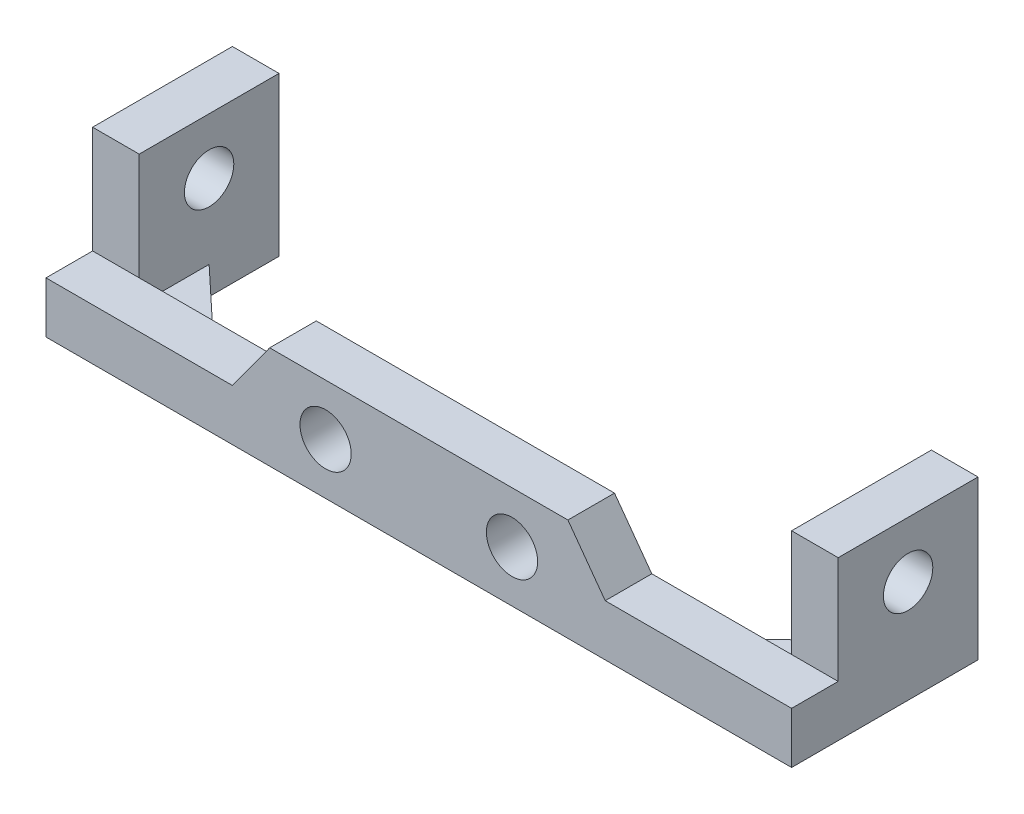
ISO-10303-21;
HEADER;
FILE_DESCRIPTION(('STEP AP214'),'2;1');
FILE_NAME('part.step','',(''),(''),'','','');
FILE_SCHEMA(('AUTOMOTIVE_DESIGN { 1 0 10303 214 1 1 1 1 }'));
ENDSEC;
DATA;
#1=APPLICATION_CONTEXT('core data for automotive mechanical design processes');
#2=APPLICATION_PROTOCOL_DEFINITION('international standard','automotive_design',2000,#1);
#3=PRODUCT_CONTEXT('',#1,'mechanical');
#4=PRODUCT('Part','Part','',(#3));
#5=PRODUCT_RELATED_PRODUCT_CATEGORY('part','',(#4));
#6=PRODUCT_DEFINITION_FORMATION('','',#4);
#7=PRODUCT_DEFINITION_CONTEXT('part definition',#1,'design');
#8=PRODUCT_DEFINITION('design','',#6,#7);
#9=PRODUCT_DEFINITION_SHAPE('','',#8);
#10=(LENGTH_UNIT() NAMED_UNIT(*) SI_UNIT(.MILLI.,.METRE.));
#11=(NAMED_UNIT(*) PLANE_ANGLE_UNIT() SI_UNIT($,.RADIAN.));
#12=(NAMED_UNIT(*) SI_UNIT($,.STERADIAN.) SOLID_ANGLE_UNIT());
#13=UNCERTAINTY_MEASURE_WITH_UNIT(LENGTH_MEASURE(1.E-05),#10,'distance_accuracy_value','');
#14=(GEOMETRIC_REPRESENTATION_CONTEXT(3) GLOBAL_UNCERTAINTY_ASSIGNED_CONTEXT((#13)) GLOBAL_UNIT_ASSIGNED_CONTEXT((#10,
#11,#12)) REPRESENTATION_CONTEXT('',''));
#15=CARTESIAN_POINT('',(0.,0.,0.));
#16=DIRECTION('',(0.,0.,1.));
#17=DIRECTION('',(1.,0.,0.));
#18=AXIS2_PLACEMENT_3D('',#15,#16,#17);
#19=CARTESIAN_POINT('',(0.,11.,-5.));
#20=DIRECTION('',(0.,0.,1.));
#21=DIRECTION('',(1.,0.,0.));
#22=AXIS2_PLACEMENT_3D('',#19,#20,#21);
#23=PLANE('',#22);
#24=CARTESIAN_POINT('',(50.,5.5,-5.));
#25=DIRECTION('',(0.,0.,1.));
#26=DIRECTION('',(1.,0.,0.));
#27=AXIS2_PLACEMENT_3D('',#24,#25,#26);
#28=CIRCLE('',#27,2.75);
#29=CARTESIAN_POINT('',(52.75,5.5,-5.));
#30=VERTEX_POINT('',#29);
#31=EDGE_CURVE('E282',#30,#30,#28,.T.);
#32=ORIENTED_EDGE('',*,*,#31,.T.);
#33=EDGE_LOOP('',(#32));
#34=FACE_BOUND('',#33,.T.);
#35=CARTESIAN_POINT('',(30.,5.5,-5.));
#36=DIRECTION('',(0.,0.,1.));
#37=DIRECTION('',(1.,0.,0.));
#38=AXIS2_PLACEMENT_3D('',#35,#36,#37);
#39=CIRCLE('',#38,2.75);
#40=CARTESIAN_POINT('',(32.75,5.5,-5.));
#41=VERTEX_POINT('',#40);
#42=EDGE_CURVE('E288',#41,#41,#39,.T.);
#43=ORIENTED_EDGE('',*,*,#42,.T.);
#44=EDGE_LOOP('',(#43));
#45=FACE_BOUND('',#44,.T.);
#46=DIRECTION('',(-1.,0.,0.));
#47=VECTOR('',#46,1.);
#48=CARTESIAN_POINT('',(75.,3.,-5.));
#49=LINE('',#48,#47);
#50=CARTESIAN_POINT('',(75.,3.,-5.));
#51=VERTEX_POINT('',#50);
#52=CARTESIAN_POINT('',(67.,3.,-5.));
#53=VERTEX_POINT('',#52);
#54=EDGE_CURVE('E177',#51,#53,#49,.T.);
#55=ORIENTED_EDGE('',*,*,#54,.T.);
#56=DIRECTION('',(0.,-1.,0.));
#57=VECTOR('',#56,1.);
#58=CARTESIAN_POINT('',(67.,3.,-5.));
#59=LINE('',#58,#57);
#60=CARTESIAN_POINT('',(67.,0.,-5.));
#61=VERTEX_POINT('',#60);
#62=EDGE_CURVE('E165',#53,#61,#59,.T.);
#63=ORIENTED_EDGE('',*,*,#62,.T.);
#64=DIRECTION('',(-1.,0.,0.));
#65=VECTOR('',#64,1.);
#66=CARTESIAN_POINT('',(0.,0.,-5.));
#67=LINE('',#66,#65);
#68=CARTESIAN_POINT('',(13.,0.,-5.));
#69=VERTEX_POINT('',#68);
#70=EDGE_CURVE('E312',#61,#69,#67,.T.);
#71=ORIENTED_EDGE('',*,*,#70,.T.);
#72=DIRECTION('',(0.,-1.,0.));
#73=VECTOR('',#72,1.);
#74=CARTESIAN_POINT('',(13.,3.,-5.));
#75=LINE('',#74,#73);
#76=CARTESIAN_POINT('',(13.,3.,-5.));
#77=VERTEX_POINT('',#76);
#78=EDGE_CURVE('E204',#77,#69,#75,.T.);
#79=ORIENTED_EDGE('',*,*,#78,.F.);
#80=DIRECTION('',(-1.,0.,0.));
#81=VECTOR('',#80,1.);
#82=CARTESIAN_POINT('',(13.,3.,-5.));
#83=LINE('',#82,#81);
#84=CARTESIAN_POINT('',(5.,3.,-5.));
#85=VERTEX_POINT('',#84);
#86=EDGE_CURVE('E198',#77,#85,#83,.T.);
#87=ORIENTED_EDGE('',*,*,#86,.T.);
#88=DIRECTION('',(0.,-1.,0.));
#89=VECTOR('',#88,1.);
#90=CARTESIAN_POINT('',(5.,17.,-5.));
#91=LINE('',#90,#89);
#92=CARTESIAN_POINT('',(5.,5.5,-5.));
#93=VERTEX_POINT('',#92);
#94=EDGE_CURVE('E11',#93,#85,#91,.T.);
#95=ORIENTED_EDGE('',*,*,#94,.F.);
#96=DIRECTION('',(-1.,0.,0.));
#97=VECTOR('',#96,1.);
#98=CARTESIAN_POINT('',(0.,5.5,-5.));
#99=LINE('',#98,#97);
#100=CARTESIAN_POINT('',(20.,5.5,-5.));
#101=VERTEX_POINT('',#100);
#102=EDGE_CURVE('E294',#101,#93,#99,.T.);
#103=ORIENTED_EDGE('',*,*,#102,.F.);
#104=DIRECTION('',(0.588171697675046,0.808736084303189,0.));
#105=VECTOR('',#104,1.);
#106=CARTESIAN_POINT('',(10.4648648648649,-7.61081081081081,-5.));
#107=LINE('',#106,#105);
#108=CARTESIAN_POINT('',(24.,11.,-5.));
#109=VERTEX_POINT('',#108);
#110=EDGE_CURVE('E298',#101,#109,#107,.T.);
#111=ORIENTED_EDGE('',*,*,#110,.T.);
#112=DIRECTION('',(-1.,0.,0.));
#113=VECTOR('',#112,1.);
#114=CARTESIAN_POINT('',(0.,11.,-5.));
#115=LINE('',#114,#113);
#116=CARTESIAN_POINT('',(56.,11.,-5.));
#117=VERTEX_POINT('',#116);
#118=EDGE_CURVE('E322',#117,#109,#115,.T.);
#119=ORIENTED_EDGE('',*,*,#118,.F.);
#120=DIRECTION('',(-0.588171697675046,0.808736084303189,0.));
#121=VECTOR('',#120,1.);
#122=CARTESIAN_POINT('',(41.8594594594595,30.4432432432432,-5.));
#123=LINE('',#122,#121);
#124=CARTESIAN_POINT('',(60.,5.5,-5.));
#125=VERTEX_POINT('',#124);
#126=EDGE_CURVE('E266',#125,#117,#123,.T.);
#127=ORIENTED_EDGE('',*,*,#126,.F.);
#128=DIRECTION('',(1.,0.,0.));
#129=VECTOR('',#128,1.);
#130=CARTESIAN_POINT('',(0.,5.5,-5.));
#131=LINE('',#130,#129);
#132=CARTESIAN_POINT('',(75.,5.5,-5.));
#133=VERTEX_POINT('',#132);
#134=EDGE_CURVE('E269',#125,#133,#131,.T.);
#135=ORIENTED_EDGE('',*,*,#134,.T.);
#136=DIRECTION('',(0.,-1.,0.));
#137=VECTOR('',#136,1.);
#138=CARTESIAN_POINT('',(75.,17.,-5.));
#139=LINE('',#138,#137);
#140=EDGE_CURVE('E183',#133,#51,#139,.T.);
#141=ORIENTED_EDGE('',*,*,#140,.T.);
#142=EDGE_LOOP('',(#55,#63,#71,#79,#87,#95,#103,#111,#119,#127,#135,#141));
#143=FACE_BOUND('',#142,.T.);
#144=ADVANCED_FACE('F32',(#34,#45,#143),#23,.F.);
#145=CARTESIAN_POINT('',(0.,11.,0.));
#146=DIRECTION('',(0.,0.,-1.));
#147=DIRECTION('',(-1.,0.,0.));
#148=AXIS2_PLACEMENT_3D('',#145,#146,#147);
#149=PLANE('',#148);
#150=CARTESIAN_POINT('',(30.,5.5,0.));
#151=DIRECTION('',(0.,0.,1.));
#152=DIRECTION('',(1.,0.,0.));
#153=AXIS2_PLACEMENT_3D('',#150,#151,#152);
#154=CIRCLE('',#153,2.75);
#155=CARTESIAN_POINT('',(32.75,5.5,0.));
#156=VERTEX_POINT('',#155);
#157=EDGE_CURVE('E285',#156,#156,#154,.T.);
#158=ORIENTED_EDGE('',*,*,#157,.F.);
#159=EDGE_LOOP('',(#158));
#160=FACE_BOUND('',#159,.T.);
#161=CARTESIAN_POINT('',(50.,5.5,0.));
#162=DIRECTION('',(0.,0.,1.));
#163=DIRECTION('',(1.,0.,0.));
#164=AXIS2_PLACEMENT_3D('',#161,#162,#163);
#165=CIRCLE('',#164,2.75);
#166=CARTESIAN_POINT('',(52.75,5.5,0.));
#167=VERTEX_POINT('',#166);
#168=EDGE_CURVE('E277',#167,#167,#165,.T.);
#169=ORIENTED_EDGE('',*,*,#168,.F.);
#170=EDGE_LOOP('',(#169));
#171=FACE_BOUND('',#170,.T.);
#172=DIRECTION('',(-0.588171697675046,0.808736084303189,0.));
#173=VECTOR('',#172,1.);
#174=CARTESIAN_POINT('',(41.8594594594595,30.4432432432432,0.));
#175=LINE('',#174,#173);
#176=CARTESIAN_POINT('',(60.,5.5,0.));
#177=VERTEX_POINT('',#176);
#178=CARTESIAN_POINT('',(56.,11.,0.));
#179=VERTEX_POINT('',#178);
#180=EDGE_CURVE('E265',#177,#179,#175,.T.);
#181=ORIENTED_EDGE('',*,*,#180,.T.);
#182=DIRECTION('',(1.,0.,0.));
#183=VECTOR('',#182,1.);
#184=CARTESIAN_POINT('',(0.,11.,0.));
#185=LINE('',#184,#183);
#186=CARTESIAN_POINT('',(24.,11.,0.));
#187=VERTEX_POINT('',#186);
#188=EDGE_CURVE('E314',#187,#179,#185,.T.);
#189=ORIENTED_EDGE('',*,*,#188,.F.);
#190=DIRECTION('',(0.588171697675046,0.808736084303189,0.));
#191=VECTOR('',#190,1.);
#192=CARTESIAN_POINT('',(10.4648648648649,-7.61081081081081,0.));
#193=LINE('',#192,#191);
#194=CARTESIAN_POINT('',(20.,5.5,0.));
#195=VERTEX_POINT('',#194);
#196=EDGE_CURVE('E304',#195,#187,#193,.T.);
#197=ORIENTED_EDGE('',*,*,#196,.F.);
#198=DIRECTION('',(-1.,0.,0.));
#199=VECTOR('',#198,1.);
#200=CARTESIAN_POINT('',(0.,5.5,0.));
#201=LINE('',#200,#199);
#202=CARTESIAN_POINT('',(0.,5.5,0.));
#203=VERTEX_POINT('',#202);
#204=EDGE_CURVE('E291',#195,#203,#201,.T.);
#205=ORIENTED_EDGE('',*,*,#204,.T.);
#206=DIRECTION('',(0.,-1.,0.));
#207=VECTOR('',#206,1.);
#208=CARTESIAN_POINT('',(0.,11.,0.));
#209=LINE('',#208,#207);
#210=CARTESIAN_POINT('',(0.,0.,0.));
#211=VERTEX_POINT('',#210);
#212=EDGE_CURVE('E41',#203,#211,#209,.T.);
#213=ORIENTED_EDGE('',*,*,#212,.T.);
#214=DIRECTION('',(1.,0.,0.));
#215=VECTOR('',#214,1.);
#216=CARTESIAN_POINT('',(0.,0.,0.));
#217=LINE('',#216,#215);
#218=CARTESIAN_POINT('',(80.,0.,0.));
#219=VERTEX_POINT('',#218);
#220=EDGE_CURVE('E397',#211,#219,#217,.T.);
#221=ORIENTED_EDGE('',*,*,#220,.T.);
#222=DIRECTION('',(0.,-1.,0.));
#223=VECTOR('',#222,1.);
#224=CARTESIAN_POINT('',(80.,11.,0.));
#225=LINE('',#224,#223);
#226=CARTESIAN_POINT('',(80.,5.5,0.));
#227=VERTEX_POINT('',#226);
#228=EDGE_CURVE('E320',#227,#219,#225,.T.);
#229=ORIENTED_EDGE('',*,*,#228,.F.);
#230=DIRECTION('',(1.,0.,0.));
#231=VECTOR('',#230,1.);
#232=CARTESIAN_POINT('',(0.,5.5,0.));
#233=LINE('',#232,#231);
#234=EDGE_CURVE('E268',#177,#227,#233,.T.);
#235=ORIENTED_EDGE('',*,*,#234,.F.);
#236=EDGE_LOOP('',(#181,#189,#197,#205,#213,#221,#229,#235));
#237=FACE_BOUND('',#236,.T.);
#238=ADVANCED_FACE('F367',(#160,#171,#237),#149,.F.);
#239=CARTESIAN_POINT('',(0.,11.,0.));
#240=DIRECTION('',(0.,-1.,0.));
#241=DIRECTION('',(0.,0.,-1.));
#242=AXIS2_PLACEMENT_3D('',#239,#240,#241);
#243=PLANE('',#242);
#244=DIRECTION('',(0.,0.,1.));
#245=VECTOR('',#244,1.);
#246=CARTESIAN_POINT('',(56.,11.,-5.));
#247=LINE('',#246,#245);
#248=EDGE_CURVE('E275',#117,#179,#247,.T.);
#249=ORIENTED_EDGE('',*,*,#248,.F.);
#250=ORIENTED_EDGE('',*,*,#118,.T.);
#251=DIRECTION('',(0.,0.,1.));
#252=VECTOR('',#251,1.);
#253=CARTESIAN_POINT('',(24.,11.,-5.));
#254=LINE('',#253,#252);
#255=EDGE_CURVE('E310',#109,#187,#254,.T.);
#256=ORIENTED_EDGE('',*,*,#255,.T.);
#257=ORIENTED_EDGE('',*,*,#188,.T.);
#258=EDGE_LOOP('',(#249,#250,#256,#257));
#259=FACE_BOUND('',#258,.T.);
#260=ADVANCED_FACE('F373',(#259),#243,.F.);
#261=CARTESIAN_POINT('',(0.,11.,0.));
#262=DIRECTION('',(1.,0.,0.));
#263=DIRECTION('',(0.,0.,-1.));
#264=AXIS2_PLACEMENT_3D('',#261,#262,#263);
#265=PLANE('',#264);
#266=CARTESIAN_POINT('',(0.,11.,-12.5));
#267=DIRECTION('',(1.,0.,0.));
#268=DIRECTION('',(0.,0.,-1.));
#269=AXIS2_PLACEMENT_3D('',#266,#267,#268);
#270=CIRCLE('',#269,2.65);
#271=CARTESIAN_POINT('',(0.,11.,-15.15));
#272=VERTEX_POINT('',#271);
#273=EDGE_CURVE('E185',#272,#272,#270,.T.);
#274=ORIENTED_EDGE('',*,*,#273,.T.);
#275=EDGE_LOOP('',(#274));
#276=FACE_BOUND('',#275,.T.);
#277=DIRECTION('',(0.,0.,1.));
#278=VECTOR('',#277,1.);
#279=CARTESIAN_POINT('',(0.,5.5,-5.));
#280=LINE('',#279,#278);
#281=CARTESIAN_POINT('',(0.,5.5,-5.));
#282=VERTEX_POINT('',#281);
#283=EDGE_CURVE('E307',#282,#203,#280,.T.);
#284=ORIENTED_EDGE('',*,*,#283,.F.);
#285=DIRECTION('',(0.,-1.,0.));
#286=VECTOR('',#285,1.);
#287=CARTESIAN_POINT('',(0.,17.,-5.));
#288=LINE('',#287,#286);
#289=CARTESIAN_POINT('',(0.,17.,-5.));
#290=VERTEX_POINT('',#289);
#291=EDGE_CURVE('E261',#290,#282,#288,.T.);
#292=ORIENTED_EDGE('',*,*,#291,.F.);
#293=DIRECTION('',(0.,0.,-1.));
#294=VECTOR('',#293,1.);
#295=CARTESIAN_POINT('',(0.,17.,-5.));
#296=LINE('',#295,#294);
#297=CARTESIAN_POINT('',(0.,17.,-20.));
#298=VERTEX_POINT('',#297);
#299=EDGE_CURVE('E239',#290,#298,#296,.T.);
#300=ORIENTED_EDGE('',*,*,#299,.T.);
#301=DIRECTION('',(0.,-1.,0.));
#302=VECTOR('',#301,1.);
#303=CARTESIAN_POINT('',(0.,17.,-20.));
#304=LINE('',#303,#302);
#305=CARTESIAN_POINT('',(0.,0.,-20.));
#306=VERTEX_POINT('',#305);
#307=EDGE_CURVE('E252',#298,#306,#304,.T.);
#308=ORIENTED_EDGE('',*,*,#307,.T.);
#309=DIRECTION('',(0.,0.,1.));
#310=VECTOR('',#309,1.);
#311=CARTESIAN_POINT('',(0.,0.,0.));
#312=LINE('',#311,#310);
#313=EDGE_CURVE('E309',#306,#211,#312,.T.);
#314=ORIENTED_EDGE('',*,*,#313,.T.);
#315=ORIENTED_EDGE('',*,*,#212,.F.);
#316=EDGE_LOOP('',(#284,#292,#300,#308,#314,#315));
#317=FACE_BOUND('',#316,.T.);
#318=ADVANCED_FACE('F34',(#276,#317),#265,.F.);
#319=CARTESIAN_POINT('',(80.,11.,0.));
#320=DIRECTION('',(-1.,0.,0.));
#321=DIRECTION('',(0.,0.,1.));
#322=AXIS2_PLACEMENT_3D('',#319,#320,#321);
#323=PLANE('',#322);
#324=CARTESIAN_POINT('',(80.,11.,-12.5));
#325=DIRECTION('',(1.,0.,0.));
#326=DIRECTION('',(0.,0.,-1.));
#327=AXIS2_PLACEMENT_3D('',#324,#325,#326);
#328=CIRCLE('',#327,2.65);
#329=CARTESIAN_POINT('',(80.,11.,-15.15));
#330=VERTEX_POINT('',#329);
#331=EDGE_CURVE('E391',#330,#330,#328,.T.);
#332=ORIENTED_EDGE('',*,*,#331,.F.);
#333=EDGE_LOOP('',(#332));
#334=FACE_BOUND('',#333,.T.);
#335=DIRECTION('',(0.,0.,-1.));
#336=VECTOR('',#335,1.);
#337=CARTESIAN_POINT('',(80.,0.,0.));
#338=LINE('',#337,#336);
#339=CARTESIAN_POINT('',(80.,0.,-20.));
#340=VERTEX_POINT('',#339);
#341=EDGE_CURVE('E315',#219,#340,#338,.T.);
#342=ORIENTED_EDGE('',*,*,#341,.T.);
#343=DIRECTION('',(0.,-1.,0.));
#344=VECTOR('',#343,1.);
#345=CARTESIAN_POINT('',(80.,17.,-20.));
#346=LINE('',#345,#344);
#347=CARTESIAN_POINT('',(80.,17.,-20.));
#348=VERTEX_POINT('',#347);
#349=EDGE_CURVE('E234',#348,#340,#346,.T.);
#350=ORIENTED_EDGE('',*,*,#349,.F.);
#351=DIRECTION('',(0.,0.,1.));
#352=VECTOR('',#351,1.);
#353=CARTESIAN_POINT('',(80.,17.,-5.));
#354=LINE('',#353,#352);
#355=CARTESIAN_POINT('',(80.,17.,-5.));
#356=VERTEX_POINT('',#355);
#357=EDGE_CURVE('E217',#348,#356,#354,.T.);
#358=ORIENTED_EDGE('',*,*,#357,.T.);
#359=DIRECTION('',(0.,-1.,0.));
#360=VECTOR('',#359,1.);
#361=CARTESIAN_POINT('',(80.,17.,-5.));
#362=LINE('',#361,#360);
#363=CARTESIAN_POINT('',(80.,5.5,-5.));
#364=VERTEX_POINT('',#363);
#365=EDGE_CURVE('E231',#356,#364,#362,.T.);
#366=ORIENTED_EDGE('',*,*,#365,.T.);
#367=DIRECTION('',(0.,0.,1.));
#368=VECTOR('',#367,1.);
#369=CARTESIAN_POINT('',(80.,5.5,-5.));
#370=LINE('',#369,#368);
#371=EDGE_CURVE('E278',#364,#227,#370,.T.);
#372=ORIENTED_EDGE('',*,*,#371,.T.);
#373=ORIENTED_EDGE('',*,*,#228,.T.);
#374=EDGE_LOOP('',(#342,#350,#358,#366,#372,#373));
#375=FACE_BOUND('',#374,.T.);
#376=ADVANCED_FACE('F379',(#334,#375),#323,.F.);
#377=CARTESIAN_POINT('',(0.,0.,0.));
#378=DIRECTION('',(0.,-1.,0.));
#379=DIRECTION('',(0.,0.,-1.));
#380=AXIS2_PLACEMENT_3D('',#377,#378,#379);
#381=PLANE('',#380);
#382=ORIENTED_EDGE('',*,*,#70,.F.);
#383=DIRECTION('',(0.729537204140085,0.,-0.68394112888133));
#384=VECTOR('',#383,1.);
#385=CARTESIAN_POINT('',(67.,0.,-5.));
#386=LINE('',#385,#384);
#387=CARTESIAN_POINT('',(75.,0.,-12.5));
#388=VERTEX_POINT('',#387);
#389=EDGE_CURVE('E49',#61,#388,#386,.T.);
#390=ORIENTED_EDGE('',*,*,#389,.T.);
#391=DIRECTION('',(0.,0.,-1.));
#392=VECTOR('',#391,1.);
#393=CARTESIAN_POINT('',(75.,0.,-5.));
#394=LINE('',#393,#392);
#395=CARTESIAN_POINT('',(75.,0.,-20.));
#396=VERTEX_POINT('',#395);
#397=EDGE_CURVE('E207',#388,#396,#394,.T.);
#398=ORIENTED_EDGE('',*,*,#397,.T.);
#399=DIRECTION('',(1.,0.,0.));
#400=VECTOR('',#399,1.);
#401=CARTESIAN_POINT('',(75.,0.,-20.));
#402=LINE('',#401,#400);
#403=EDGE_CURVE('E214',#396,#340,#402,.T.);
#404=ORIENTED_EDGE('',*,*,#403,.T.);
#405=ORIENTED_EDGE('',*,*,#341,.F.);
#406=ORIENTED_EDGE('',*,*,#220,.F.);
#407=ORIENTED_EDGE('',*,*,#313,.F.);
#408=DIRECTION('',(1.,0.,0.));
#409=VECTOR('',#408,1.);
#410=CARTESIAN_POINT('',(0.,0.,-20.));
#411=LINE('',#410,#409);
#412=CARTESIAN_POINT('',(5.,0.,-20.));
#413=VERTEX_POINT('',#412);
#414=EDGE_CURVE('E230',#306,#413,#411,.T.);
#415=ORIENTED_EDGE('',*,*,#414,.T.);
#416=DIRECTION('',(0.,0.,1.));
#417=VECTOR('',#416,1.);
#418=CARTESIAN_POINT('',(5.,0.,-5.));
#419=LINE('',#418,#417);
#420=CARTESIAN_POINT('',(5.,0.,-12.5));
#421=VERTEX_POINT('',#420);
#422=EDGE_CURVE('E243',#413,#421,#419,.T.);
#423=ORIENTED_EDGE('',*,*,#422,.T.);
#424=DIRECTION('',(0.729537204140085,0.,0.68394112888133));
#425=VECTOR('',#424,1.);
#426=CARTESIAN_POINT('',(5.,0.,-12.5));
#427=LINE('',#426,#425);
#428=EDGE_CURVE('E191',#421,#69,#427,.T.);
#429=ORIENTED_EDGE('',*,*,#428,.T.);
#430=EDGE_LOOP('',(#382,#390,#398,#404,#405,#406,#407,#415,#423,#429));
#431=FACE_BOUND('',#430,.T.);
#432=ADVANCED_FACE('F325',(#431),#381,.T.);
#433=CARTESIAN_POINT('',(0.,5.5,-5.));
#434=DIRECTION('',(0.,1.,0.));
#435=DIRECTION('',(0.,0.,1.));
#436=AXIS2_PLACEMENT_3D('',#433,#434,#435);
#437=PLANE('',#436);
#438=ORIENTED_EDGE('',*,*,#204,.F.);
#439=DIRECTION('',(0.,0.,1.));
#440=VECTOR('',#439,1.);
#441=CARTESIAN_POINT('',(20.,5.5,-5.));
#442=LINE('',#441,#440);
#443=EDGE_CURVE('E438',#101,#195,#442,.T.);
#444=ORIENTED_EDGE('',*,*,#443,.F.);
#445=ORIENTED_EDGE('',*,*,#102,.T.);
#446=EDGE_CURVE('E299',#93,#282,#99,.T.);
#447=ORIENTED_EDGE('',*,*,#446,.T.);
#448=ORIENTED_EDGE('',*,*,#283,.T.);
#449=EDGE_LOOP('',(#438,#444,#445,#447,#448));
#450=FACE_BOUND('',#449,.T.);
#451=ADVANCED_FACE('F386',(#450),#437,.T.);
#452=CARTESIAN_POINT('',(10.4648648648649,-7.61081081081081,-5.));
#453=DIRECTION('',(0.808736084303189,-0.588171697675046,0.));
#454=DIRECTION('',(0.588171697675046,0.808736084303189,0.));
#455=AXIS2_PLACEMENT_3D('',#452,#453,#454);
#456=PLANE('',#455);
#457=ORIENTED_EDGE('',*,*,#196,.T.);
#458=ORIENTED_EDGE('',*,*,#255,.F.);
#459=ORIENTED_EDGE('',*,*,#110,.F.);
#460=ORIENTED_EDGE('',*,*,#443,.T.);
#461=EDGE_LOOP('',(#457,#458,#459,#460));
#462=FACE_BOUND('',#461,.T.);
#463=ADVANCED_FACE('F444',(#462),#456,.F.);
#464=CARTESIAN_POINT('',(30.,5.5,-5.));
#465=DIRECTION('',(0.,0.,1.));
#466=DIRECTION('',(1.,0.,0.));
#467=AXIS2_PLACEMENT_3D('',#464,#465,#466);
#468=CYLINDRICAL_SURFACE('',#467,2.75);
#469=ORIENTED_EDGE('',*,*,#42,.F.);
#470=EDGE_LOOP('',(#469));
#471=FACE_BOUND('',#470,.T.);
#472=ORIENTED_EDGE('',*,*,#157,.T.);
#473=EDGE_LOOP('',(#472));
#474=FACE_BOUND('',#473,.T.);
#475=ADVANCED_FACE('F461',(#471,#474),#468,.F.);
#476=CARTESIAN_POINT('',(50.,5.5,-5.));
#477=DIRECTION('',(0.,0.,1.));
#478=DIRECTION('',(1.,0.,0.));
#479=AXIS2_PLACEMENT_3D('',#476,#477,#478);
#480=CYLINDRICAL_SURFACE('',#479,2.75);
#481=ORIENTED_EDGE('',*,*,#31,.F.);
#482=EDGE_LOOP('',(#481));
#483=FACE_BOUND('',#482,.T.);
#484=ORIENTED_EDGE('',*,*,#168,.T.);
#485=EDGE_LOOP('',(#484));
#486=FACE_BOUND('',#485,.T.);
#487=ADVANCED_FACE('F456',(#483,#486),#480,.F.);
#488=CARTESIAN_POINT('',(41.8594594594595,30.4432432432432,-5.));
#489=DIRECTION('',(0.808736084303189,0.588171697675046,0.));
#490=DIRECTION('',(-0.588171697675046,0.808736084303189,0.));
#491=AXIS2_PLACEMENT_3D('',#488,#489,#490);
#492=PLANE('',#491);
#493=ORIENTED_EDGE('',*,*,#180,.F.);
#494=DIRECTION('',(0.,0.,1.));
#495=VECTOR('',#494,1.);
#496=CARTESIAN_POINT('',(60.,5.5,-5.));
#497=LINE('',#496,#495);
#498=EDGE_CURVE('E271',#125,#177,#497,.T.);
#499=ORIENTED_EDGE('',*,*,#498,.F.);
#500=ORIENTED_EDGE('',*,*,#126,.T.);
#501=ORIENTED_EDGE('',*,*,#248,.T.);
#502=EDGE_LOOP('',(#493,#499,#500,#501));
#503=FACE_BOUND('',#502,.T.);
#504=ADVANCED_FACE('F427',(#503),#492,.T.);
#505=CARTESIAN_POINT('',(0.,5.5,-5.));
#506=DIRECTION('',(0.,-1.,0.));
#507=DIRECTION('',(0.,0.,-1.));
#508=AXIS2_PLACEMENT_3D('',#505,#506,#507);
#509=PLANE('',#508);
#510=ORIENTED_EDGE('',*,*,#234,.T.);
#511=ORIENTED_EDGE('',*,*,#371,.F.);
#512=EDGE_CURVE('E57',#133,#364,#131,.T.);
#513=ORIENTED_EDGE('',*,*,#512,.F.);
#514=ORIENTED_EDGE('',*,*,#134,.F.);
#515=ORIENTED_EDGE('',*,*,#498,.T.);
#516=EDGE_LOOP('',(#510,#511,#513,#514,#515));
#517=FACE_BOUND('',#516,.T.);
#518=ADVANCED_FACE('F423',(#517),#509,.F.);
#519=CARTESIAN_POINT('',(0.,17.,-5.));
#520=DIRECTION('',(0.,0.,1.));
#521=DIRECTION('',(1.,0.,0.));
#522=AXIS2_PLACEMENT_3D('',#519,#520,#521);
#523=PLANE('',#522);
#524=ORIENTED_EDGE('',*,*,#446,.F.);
#525=CARTESIAN_POINT('',(5.,17.,-5.));
#526=VERTEX_POINT('',#525);
#527=EDGE_CURVE('E257',#526,#93,#91,.T.);
#528=ORIENTED_EDGE('',*,*,#527,.F.);
#529=DIRECTION('',(-1.,0.,0.));
#530=VECTOR('',#529,1.);
#531=CARTESIAN_POINT('',(0.,17.,-5.));
#532=LINE('',#531,#530);
#533=EDGE_CURVE('E249',#526,#290,#532,.T.);
#534=ORIENTED_EDGE('',*,*,#533,.T.);
#535=ORIENTED_EDGE('',*,*,#291,.T.);
#536=EDGE_LOOP('',(#524,#528,#534,#535));
#537=FACE_BOUND('',#536,.T.);
#538=ADVANCED_FACE('F362',(#537),#523,.T.);
#539=CARTESIAN_POINT('',(5.,17.,-5.));
#540=DIRECTION('',(1.,0.,0.));
#541=DIRECTION('',(0.,0.,-1.));
#542=AXIS2_PLACEMENT_3D('',#539,#540,#541);
#543=PLANE('',#542);
#544=CARTESIAN_POINT('',(5.,11.,-12.5));
#545=DIRECTION('',(1.,0.,0.));
#546=DIRECTION('',(0.,0.,-1.));
#547=AXIS2_PLACEMENT_3D('',#544,#545,#546);
#548=CIRCLE('',#547,2.65);
#549=CARTESIAN_POINT('',(5.,11.,-15.15));
#550=VERTEX_POINT('',#549);
#551=EDGE_CURVE('E652',#550,#550,#548,.T.);
#552=ORIENTED_EDGE('',*,*,#551,.F.);
#553=EDGE_LOOP('',(#552));
#554=FACE_BOUND('',#553,.T.);
#555=DIRECTION('',(0.,-1.,0.));
#556=VECTOR('',#555,1.);
#557=CARTESIAN_POINT('',(5.,3.,-12.5));
#558=LINE('',#557,#556);
#559=CARTESIAN_POINT('',(5.,3.,-12.5));
#560=VERTEX_POINT('',#559);
#561=EDGE_CURVE('E201',#560,#421,#558,.T.);
#562=ORIENTED_EDGE('',*,*,#561,.T.);
#563=ORIENTED_EDGE('',*,*,#422,.F.);
#564=DIRECTION('',(0.,-1.,0.));
#565=VECTOR('',#564,1.);
#566=CARTESIAN_POINT('',(5.,17.,-20.));
#567=LINE('',#566,#565);
#568=CARTESIAN_POINT('',(5.,17.,-20.));
#569=VERTEX_POINT('',#568);
#570=EDGE_CURVE('E329',#569,#413,#567,.T.);
#571=ORIENTED_EDGE('',*,*,#570,.F.);
#572=DIRECTION('',(0.,0.,1.));
#573=VECTOR('',#572,1.);
#574=CARTESIAN_POINT('',(5.,17.,-5.));
#575=LINE('',#574,#573);
#576=EDGE_CURVE('E246',#569,#526,#575,.T.);
#577=ORIENTED_EDGE('',*,*,#576,.T.);
#578=ORIENTED_EDGE('',*,*,#527,.T.);
#579=ORIENTED_EDGE('',*,*,#94,.T.);
#580=DIRECTION('',(0.,0.,-1.));
#581=VECTOR('',#580,1.);
#582=CARTESIAN_POINT('',(5.,3.,-5.));
#583=LINE('',#582,#581);
#584=EDGE_CURVE('E193',#85,#560,#583,.T.);
#585=ORIENTED_EDGE('',*,*,#584,.T.);
#586=EDGE_LOOP('',(#562,#563,#571,#577,#578,#579,#585));
#587=FACE_BOUND('',#586,.T.);
#588=ADVANCED_FACE('F328',(#554,#587),#543,.T.);
#589=CARTESIAN_POINT('',(0.,17.,-20.));
#590=DIRECTION('',(0.,0.,-1.));
#591=DIRECTION('',(-1.,0.,0.));
#592=AXIS2_PLACEMENT_3D('',#589,#590,#591);
#593=PLANE('',#592);
#594=ORIENTED_EDGE('',*,*,#414,.F.);
#595=ORIENTED_EDGE('',*,*,#307,.F.);
#596=DIRECTION('',(1.,0.,0.));
#597=VECTOR('',#596,1.);
#598=CARTESIAN_POINT('',(0.,17.,-20.));
#599=LINE('',#598,#597);
#600=EDGE_CURVE('E242',#298,#569,#599,.T.);
#601=ORIENTED_EDGE('',*,*,#600,.T.);
#602=ORIENTED_EDGE('',*,*,#570,.T.);
#603=EDGE_LOOP('',(#594,#595,#601,#602));
#604=FACE_BOUND('',#603,.T.);
#605=ADVANCED_FACE('F351',(#604),#593,.T.);
#606=CARTESIAN_POINT('',(0.,17.,0.));
#607=DIRECTION('',(0.,-1.,0.));
#608=DIRECTION('',(0.,0.,-1.));
#609=AXIS2_PLACEMENT_3D('',#606,#607,#608);
#610=PLANE('',#609);
#611=ORIENTED_EDGE('',*,*,#299,.F.);
#612=ORIENTED_EDGE('',*,*,#533,.F.);
#613=ORIENTED_EDGE('',*,*,#576,.F.);
#614=ORIENTED_EDGE('',*,*,#600,.F.);
#615=EDGE_LOOP('',(#611,#612,#613,#614));
#616=FACE_BOUND('',#615,.T.);
#617=ADVANCED_FACE('F353',(#616),#610,.F.);
#618=CARTESIAN_POINT('',(75.,17.,-5.));
#619=DIRECTION('',(0.,0.,1.));
#620=DIRECTION('',(1.,0.,0.));
#621=AXIS2_PLACEMENT_3D('',#618,#619,#620);
#622=PLANE('',#621);
#623=ORIENTED_EDGE('',*,*,#512,.T.);
#624=ORIENTED_EDGE('',*,*,#365,.F.);
#625=DIRECTION('',(-1.,0.,0.));
#626=VECTOR('',#625,1.);
#627=CARTESIAN_POINT('',(75.,17.,-5.));
#628=LINE('',#627,#626);
#629=CARTESIAN_POINT('',(75.,17.,-5.));
#630=VERTEX_POINT('',#629);
#631=EDGE_CURVE('E220',#356,#630,#628,.T.);
#632=ORIENTED_EDGE('',*,*,#631,.T.);
#633=EDGE_CURVE('E227',#630,#133,#139,.T.);
#634=ORIENTED_EDGE('',*,*,#633,.T.);
#635=EDGE_LOOP('',(#623,#624,#632,#634));
#636=FACE_BOUND('',#635,.T.);
#637=ADVANCED_FACE('F359',(#636),#622,.T.);
#638=CARTESIAN_POINT('',(75.,17.,-5.));
#639=DIRECTION('',(-1.,0.,0.));
#640=DIRECTION('',(0.,0.,1.));
#641=AXIS2_PLACEMENT_3D('',#638,#639,#640);
#642=PLANE('',#641);
#643=CARTESIAN_POINT('',(75.,11.,-12.5));
#644=DIRECTION('',(-1.,0.,0.));
#645=DIRECTION('',(0.,0.,1.));
#646=AXIS2_PLACEMENT_3D('',#643,#644,#645);
#647=CIRCLE('',#646,2.65);
#648=CARTESIAN_POINT('',(75.,11.,-15.15));
#649=VERTEX_POINT('',#648);
#650=EDGE_CURVE('E36',#649,#649,#647,.T.);
#651=ORIENTED_EDGE('',*,*,#650,.F.);
#652=EDGE_LOOP('',(#651));
#653=FACE_BOUND('',#652,.T.);
#654=DIRECTION('',(0.,-1.,0.));
#655=VECTOR('',#654,1.);
#656=CARTESIAN_POINT('',(75.,3.,-12.5));
#657=LINE('',#656,#655);
#658=CARTESIAN_POINT('',(75.,3.,-12.5));
#659=VERTEX_POINT('',#658);
#660=EDGE_CURVE('E172',#659,#388,#657,.T.);
#661=ORIENTED_EDGE('',*,*,#660,.F.);
#662=DIRECTION('',(0.,0.,1.));
#663=VECTOR('',#662,1.);
#664=CARTESIAN_POINT('',(75.,3.,-12.5));
#665=LINE('',#664,#663);
#666=EDGE_CURVE('E173',#659,#51,#665,.T.);
#667=ORIENTED_EDGE('',*,*,#666,.T.);
#668=ORIENTED_EDGE('',*,*,#140,.F.);
#669=ORIENTED_EDGE('',*,*,#633,.F.);
#670=DIRECTION('',(0.,0.,-1.));
#671=VECTOR('',#670,1.);
#672=CARTESIAN_POINT('',(75.,17.,-5.));
#673=LINE('',#672,#671);
#674=CARTESIAN_POINT('',(75.,17.,-20.));
#675=VERTEX_POINT('',#674);
#676=EDGE_CURVE('E210',#630,#675,#673,.T.);
#677=ORIENTED_EDGE('',*,*,#676,.T.);
#678=DIRECTION('',(0.,-1.,0.));
#679=VECTOR('',#678,1.);
#680=CARTESIAN_POINT('',(75.,17.,-20.));
#681=LINE('',#680,#679);
#682=EDGE_CURVE('E223',#675,#396,#681,.T.);
#683=ORIENTED_EDGE('',*,*,#682,.T.);
#684=ORIENTED_EDGE('',*,*,#397,.F.);
#685=EDGE_LOOP('',(#661,#667,#668,#669,#677,#683,#684));
#686=FACE_BOUND('',#685,.T.);
#687=ADVANCED_FACE('F404',(#653,#686),#642,.T.);
#688=CARTESIAN_POINT('',(75.,17.,-20.));
#689=DIRECTION('',(0.,0.,-1.));
#690=DIRECTION('',(-1.,0.,0.));
#691=AXIS2_PLACEMENT_3D('',#688,#689,#690);
#692=PLANE('',#691);
#693=ORIENTED_EDGE('',*,*,#403,.F.);
#694=ORIENTED_EDGE('',*,*,#682,.F.);
#695=DIRECTION('',(1.,0.,0.));
#696=VECTOR('',#695,1.);
#697=CARTESIAN_POINT('',(75.,17.,-20.));
#698=LINE('',#697,#696);
#699=EDGE_CURVE('E213',#675,#348,#698,.T.);
#700=ORIENTED_EDGE('',*,*,#699,.T.);
#701=ORIENTED_EDGE('',*,*,#349,.T.);
#702=EDGE_LOOP('',(#693,#694,#700,#701));
#703=FACE_BOUND('',#702,.T.);
#704=ADVANCED_FACE('F400',(#703),#692,.T.);
#705=CARTESIAN_POINT('',(0.,17.,0.));
#706=DIRECTION('',(0.,-1.,0.));
#707=DIRECTION('',(0.,0.,-1.));
#708=AXIS2_PLACEMENT_3D('',#705,#706,#707);
#709=PLANE('',#708);
#710=ORIENTED_EDGE('',*,*,#676,.F.);
#711=ORIENTED_EDGE('',*,*,#631,.F.);
#712=ORIENTED_EDGE('',*,*,#357,.F.);
#713=ORIENTED_EDGE('',*,*,#699,.F.);
#714=EDGE_LOOP('',(#710,#711,#712,#713));
#715=FACE_BOUND('',#714,.T.);
#716=ADVANCED_FACE('F407',(#715),#709,.F.);
#717=CARTESIAN_POINT('',(5.,3.,-12.5));
#718=DIRECTION('',(0.68394112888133,0.,-0.729537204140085));
#719=DIRECTION('',(-0.729537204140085,0.,-0.68394112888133));
#720=AXIS2_PLACEMENT_3D('',#717,#718,#719);
#721=PLANE('',#720);
#722=ORIENTED_EDGE('',*,*,#428,.F.);
#723=ORIENTED_EDGE('',*,*,#561,.F.);
#724=DIRECTION('',(0.729537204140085,0.,0.68394112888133));
#725=VECTOR('',#724,1.);
#726=CARTESIAN_POINT('',(5.,3.,-12.5));
#727=LINE('',#726,#725);
#728=EDGE_CURVE('E196',#560,#77,#727,.T.);
#729=ORIENTED_EDGE('',*,*,#728,.T.);
#730=ORIENTED_EDGE('',*,*,#78,.T.);
#731=EDGE_LOOP('',(#722,#723,#729,#730));
#732=FACE_BOUND('',#731,.T.);
#733=ADVANCED_FACE('F333',(#732),#721,.T.);
#734=CARTESIAN_POINT('',(0.,3.,0.));
#735=DIRECTION('',(0.,1.,0.));
#736=DIRECTION('',(0.,0.,1.));
#737=AXIS2_PLACEMENT_3D('',#734,#735,#736);
#738=PLANE('',#737);
#739=ORIENTED_EDGE('',*,*,#584,.F.);
#740=ORIENTED_EDGE('',*,*,#86,.F.);
#741=ORIENTED_EDGE('',*,*,#728,.F.);
#742=EDGE_LOOP('',(#739,#740,#741));
#743=FACE_BOUND('',#742,.T.);
#744=ADVANCED_FACE('F336',(#743),#738,.T.);
#745=CARTESIAN_POINT('',(67.,3.,-5.));
#746=DIRECTION('',(-0.68394112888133,0.,-0.729537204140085));
#747=DIRECTION('',(-0.729537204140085,0.,0.68394112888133));
#748=AXIS2_PLACEMENT_3D('',#745,#746,#747);
#749=PLANE('',#748);
#750=ORIENTED_EDGE('',*,*,#389,.F.);
#751=ORIENTED_EDGE('',*,*,#62,.F.);
#752=DIRECTION('',(0.729537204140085,0.,-0.68394112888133));
#753=VECTOR('',#752,1.);
#754=CARTESIAN_POINT('',(67.,3.,-5.));
#755=LINE('',#754,#753);
#756=EDGE_CURVE('E168',#53,#659,#755,.T.);
#757=ORIENTED_EDGE('',*,*,#756,.T.);
#758=ORIENTED_EDGE('',*,*,#660,.T.);
#759=EDGE_LOOP('',(#750,#751,#757,#758));
#760=FACE_BOUND('',#759,.T.);
#761=ADVANCED_FACE('F167',(#760),#749,.T.);
#762=CARTESIAN_POINT('',(0.,3.,0.));
#763=DIRECTION('',(0.,1.,0.));
#764=DIRECTION('',(0.,0.,1.));
#765=AXIS2_PLACEMENT_3D('',#762,#763,#764);
#766=PLANE('',#765);
#767=ORIENTED_EDGE('',*,*,#54,.F.);
#768=ORIENTED_EDGE('',*,*,#666,.F.);
#769=ORIENTED_EDGE('',*,*,#756,.F.);
#770=EDGE_LOOP('',(#767,#768,#769));
#771=FACE_BOUND('',#770,.T.);
#772=ADVANCED_FACE('F176',(#771),#766,.T.);
#773=CARTESIAN_POINT('',(-5.00000000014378E-05,11.,-12.5));
#774=DIRECTION('',(1.,0.,0.));
#775=DIRECTION('',(0.,0.,-1.));
#776=AXIS2_PLACEMENT_3D('',#773,#774,#775);
#777=CYLINDRICAL_SURFACE('',#776,2.65);
#778=CARTESIAN_POINT('',(75.,11.,-15.15));
#779=CARTESIAN_POINT('',(75.0520833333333,11.,-15.15));
#780=CARTESIAN_POINT('',(75.1041666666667,11.,-15.15));
#781=CARTESIAN_POINT('',(75.2083333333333,11.,-15.15));
#782=CARTESIAN_POINT('',(75.2604166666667,11.,-15.15));
#783=CARTESIAN_POINT('',(75.3645833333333,11.,-15.15));
#784=CARTESIAN_POINT('',(75.4166666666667,11.,-15.15));
#785=CARTESIAN_POINT('',(75.5208333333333,11.,-15.15));
#786=CARTESIAN_POINT('',(75.5729166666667,11.,-15.15));
#787=CARTESIAN_POINT('',(75.6770833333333,11.,-15.15));
#788=CARTESIAN_POINT('',(75.7291666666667,11.,-15.15));
#789=CARTESIAN_POINT('',(75.8333333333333,11.,-15.15));
#790=CARTESIAN_POINT('',(75.8854166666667,11.,-15.15));
#791=CARTESIAN_POINT('',(75.9895833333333,11.,-15.15));
#792=CARTESIAN_POINT('',(76.0416666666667,11.,-15.15));
#793=CARTESIAN_POINT('',(76.1458333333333,11.,-15.15));
#794=CARTESIAN_POINT('',(76.1979166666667,11.,-15.15));
#795=CARTESIAN_POINT('',(76.3020833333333,11.,-15.15));
#796=CARTESIAN_POINT('',(76.3541666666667,11.,-15.15));
#797=CARTESIAN_POINT('',(76.4583333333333,11.,-15.15));
#798=CARTESIAN_POINT('',(76.5104166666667,11.,-15.15));
#799=CARTESIAN_POINT('',(76.6145833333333,11.,-15.15));
#800=CARTESIAN_POINT('',(76.6666666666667,11.,-15.15));
#801=CARTESIAN_POINT('',(76.7708333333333,11.,-15.15));
#802=CARTESIAN_POINT('',(76.8229166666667,11.,-15.15));
#803=CARTESIAN_POINT('',(76.9270833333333,11.,-15.15));
#804=CARTESIAN_POINT('',(76.9791666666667,11.,-15.15));
#805=CARTESIAN_POINT('',(77.0833333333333,11.,-15.15));
#806=CARTESIAN_POINT('',(77.1354166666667,11.,-15.15));
#807=CARTESIAN_POINT('',(77.2395833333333,11.,-15.15));
#808=CARTESIAN_POINT('',(77.2916666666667,11.,-15.15));
#809=CARTESIAN_POINT('',(77.3958333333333,11.,-15.15));
#810=CARTESIAN_POINT('',(77.4479166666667,11.,-15.15));
#811=CARTESIAN_POINT('',(77.5520833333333,11.,-15.15));
#812=CARTESIAN_POINT('',(77.6041666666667,11.,-15.15));
#813=CARTESIAN_POINT('',(77.7083333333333,11.,-15.15));
#814=CARTESIAN_POINT('',(77.7604166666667,11.,-15.15));
#815=CARTESIAN_POINT('',(77.8645833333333,11.,-15.15));
#816=CARTESIAN_POINT('',(77.9166666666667,11.,-15.15));
#817=CARTESIAN_POINT('',(78.0208333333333,11.,-15.15));
#818=CARTESIAN_POINT('',(78.0729166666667,11.,-15.15));
#819=CARTESIAN_POINT('',(78.1770833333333,11.,-15.15));
#820=CARTESIAN_POINT('',(78.2291666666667,11.,-15.15));
#821=CARTESIAN_POINT('',(78.3333333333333,11.,-15.15));
#822=CARTESIAN_POINT('',(78.3854166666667,11.,-15.15));
#823=CARTESIAN_POINT('',(78.4895833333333,11.,-15.15));
#824=CARTESIAN_POINT('',(78.5416666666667,11.,-15.15));
#825=CARTESIAN_POINT('',(78.6458333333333,11.,-15.15));
#826=CARTESIAN_POINT('',(78.6979166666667,11.,-15.15));
#827=CARTESIAN_POINT('',(78.8020833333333,11.,-15.15));
#828=CARTESIAN_POINT('',(78.8541666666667,11.,-15.15));
#829=CARTESIAN_POINT('',(78.9583333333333,11.,-15.15));
#830=CARTESIAN_POINT('',(79.0104166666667,11.,-15.15));
#831=CARTESIAN_POINT('',(79.1145833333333,11.,-15.15));
#832=CARTESIAN_POINT('',(79.1666666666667,11.,-15.15));
#833=CARTESIAN_POINT('',(79.2708333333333,11.,-15.15));
#834=CARTESIAN_POINT('',(79.3229166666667,11.,-15.15));
#835=CARTESIAN_POINT('',(79.4270833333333,11.,-15.15));
#836=CARTESIAN_POINT('',(79.4791666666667,11.,-15.15));
#837=CARTESIAN_POINT('',(79.5833333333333,11.,-15.15));
#838=CARTESIAN_POINT('',(79.6354166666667,11.,-15.15));
#839=CARTESIAN_POINT('',(79.7395833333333,11.,-15.15));
#840=CARTESIAN_POINT('',(79.7916666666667,11.,-15.15));
#841=CARTESIAN_POINT('',(79.8958333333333,11.,-15.15));
#842=CARTESIAN_POINT('',(79.9479166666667,11.,-15.15));
#843=CARTESIAN_POINT('',(80.,11.,-15.15));
#844=B_SPLINE_CURVE_WITH_KNOTS('',3,(#778,#779,#780,#781,#782,#783,#784,#785,#786,#787,#788,
#789,#790,#791,#792,#793,#794,#795,#796,#797,#798,#799,#800,#801,#802,#803,#804,#805,#806,#807,
#808,#809,#810,#811,#812,#813,#814,#815,#816,#817,#818,#819,#820,#821,#822,#823,#824,#825,#826,
#827,#828,#829,#830,#831,#832,#833,#834,#835,#836,#837,#838,#839,#840,#841,#842,#843),
.UNSPECIFIED.,.F.,.F.,(4,2,2,2,2,2,2,2,2,2,2,2,2,2,2,2,2,2,2,2,2,2,2,2,2,2,2,2,2,2,2,2,4),(0.,
0.156249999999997,0.312499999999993,0.468750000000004,0.625000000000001,0.781249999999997,
0.937500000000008,1.09375,1.25,1.40625,1.56249999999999,1.71875,1.875,2.03125,2.18750000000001,
2.34375000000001,2.5,2.65625,2.8125,2.96875000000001,3.125,3.28125,3.43750000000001,
3.59375000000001,3.75,3.90625,4.0625,4.21875000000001,4.375,4.53125,4.68750000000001,
4.84375000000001,5.),.UNSPECIFIED.);
#845=EDGE_CURVE('BSEAM515',#649,#330,#844,.T.);
#846=ORIENTED_EDGE('',*,*,#650,.T.);
#847=ORIENTED_EDGE('',*,*,#331,.T.);
#848=ORIENTED_EDGE('',*,*,#845,.T.);
#849=ORIENTED_EDGE('',*,*,#845,.F.);
#850=EDGE_LOOP('',(#846,#848,#847,#849));
#851=FACE_BOUND('',#850,.T.);
#852=ADVANCED_FACE('F515',(#851),#777,.F.);
#853=CARTESIAN_POINT('',(5.,11.,-15.15));
#854=CARTESIAN_POINT('',(4.94791666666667,11.,-15.15));
#855=CARTESIAN_POINT('',(4.89583333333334,11.,-15.15));
#856=CARTESIAN_POINT('',(4.79166666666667,11.,-15.15));
#857=CARTESIAN_POINT('',(4.73958333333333,11.,-15.15));
#858=CARTESIAN_POINT('',(4.63541666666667,11.,-15.15));
#859=CARTESIAN_POINT('',(4.58333333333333,11.,-15.15));
#860=CARTESIAN_POINT('',(4.47916666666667,11.,-15.15));
#861=CARTESIAN_POINT('',(4.42708333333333,11.,-15.15));
#862=CARTESIAN_POINT('',(4.32291666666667,11.,-15.15));
#863=CARTESIAN_POINT('',(4.27083333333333,11.,-15.15));
#864=CARTESIAN_POINT('',(4.16666666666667,11.,-15.15));
#865=CARTESIAN_POINT('',(4.11458333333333,11.,-15.15));
#866=CARTESIAN_POINT('',(4.01041666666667,11.,-15.15));
#867=CARTESIAN_POINT('',(3.95833333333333,11.,-15.15));
#868=CARTESIAN_POINT('',(3.85416666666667,11.,-15.15));
#869=CARTESIAN_POINT('',(3.80208333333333,11.,-15.15));
#870=CARTESIAN_POINT('',(3.69791666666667,11.,-15.15));
#871=CARTESIAN_POINT('',(3.64583333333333,11.,-15.15));
#872=CARTESIAN_POINT('',(3.54166666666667,11.,-15.15));
#873=CARTESIAN_POINT('',(3.48958333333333,11.,-15.15));
#874=CARTESIAN_POINT('',(3.38541666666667,11.,-15.15));
#875=CARTESIAN_POINT('',(3.33333333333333,11.,-15.15));
#876=CARTESIAN_POINT('',(3.22916666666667,11.,-15.15));
#877=CARTESIAN_POINT('',(3.17708333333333,11.,-15.15));
#878=CARTESIAN_POINT('',(3.07291666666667,11.,-15.15));
#879=CARTESIAN_POINT('',(3.02083333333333,11.,-15.15));
#880=CARTESIAN_POINT('',(2.91666666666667,11.,-15.15));
#881=CARTESIAN_POINT('',(2.86458333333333,11.,-15.15));
#882=CARTESIAN_POINT('',(2.76041666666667,11.,-15.15));
#883=CARTESIAN_POINT('',(2.70833333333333,11.,-15.15));
#884=CARTESIAN_POINT('',(2.60416666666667,11.,-15.15));
#885=CARTESIAN_POINT('',(2.55208333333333,11.,-15.15));
#886=CARTESIAN_POINT('',(2.44791666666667,11.,-15.15));
#887=CARTESIAN_POINT('',(2.39583333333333,11.,-15.15));
#888=CARTESIAN_POINT('',(2.29166666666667,11.,-15.15));
#889=CARTESIAN_POINT('',(2.23958333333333,11.,-15.15));
#890=CARTESIAN_POINT('',(2.13541666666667,11.,-15.15));
#891=CARTESIAN_POINT('',(2.08333333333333,11.,-15.15));
#892=CARTESIAN_POINT('',(1.97916666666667,11.,-15.15));
#893=CARTESIAN_POINT('',(1.92708333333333,11.,-15.15));
#894=CARTESIAN_POINT('',(1.82291666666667,11.,-15.15));
#895=CARTESIAN_POINT('',(1.77083333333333,11.,-15.15));
#896=CARTESIAN_POINT('',(1.66666666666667,11.,-15.15));
#897=CARTESIAN_POINT('',(1.61458333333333,11.,-15.15));
#898=CARTESIAN_POINT('',(1.51041666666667,11.,-15.15));
#899=CARTESIAN_POINT('',(1.45833333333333,11.,-15.15));
#900=CARTESIAN_POINT('',(1.35416666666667,11.,-15.15));
#901=CARTESIAN_POINT('',(1.30208333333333,11.,-15.15));
#902=CARTESIAN_POINT('',(1.19791666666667,11.,-15.15));
#903=CARTESIAN_POINT('',(1.14583333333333,11.,-15.15));
#904=CARTESIAN_POINT('',(1.04166666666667,11.,-15.15));
#905=CARTESIAN_POINT('',(0.989583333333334,11.,-15.15));
#906=CARTESIAN_POINT('',(0.885416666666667,11.,-15.15));
#907=CARTESIAN_POINT('',(0.833333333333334,11.,-15.15));
#908=CARTESIAN_POINT('',(0.729166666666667,11.,-15.15));
#909=CARTESIAN_POINT('',(0.677083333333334,11.,-15.15));
#910=CARTESIAN_POINT('',(0.572916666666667,11.,-15.15));
#911=CARTESIAN_POINT('',(0.520833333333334,11.,-15.15));
#912=CARTESIAN_POINT('',(0.416666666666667,11.,-15.15));
#913=CARTESIAN_POINT('',(0.364583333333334,11.,-15.15));
#914=CARTESIAN_POINT('',(0.260416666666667,11.,-15.15));
#915=CARTESIAN_POINT('',(0.208333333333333,11.,-15.15));
#916=CARTESIAN_POINT('',(0.104166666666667,11.,-15.15));
#917=CARTESIAN_POINT('',(0.0520833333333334,11.,-15.15));
#918=CARTESIAN_POINT('',(0.,11.,-15.15));
#919=B_SPLINE_CURVE_WITH_KNOTS('',3,(#853,#854,#855,#856,#857,#858,#859,#860,#861,#862,#863,
#864,#865,#866,#867,#868,#869,#870,#871,#872,#873,#874,#875,#876,#877,#878,#879,#880,#881,#882,
#883,#884,#885,#886,#887,#888,#889,#890,#891,#892,#893,#894,#895,#896,#897,#898,#899,#900,#901,
#902,#903,#904,#905,#906,#907,#908,#909,#910,#911,#912,#913,#914,#915,#916,#917,#918),
.UNSPECIFIED.,.F.,.F.,(4,2,2,2,2,2,2,2,2,2,2,2,2,2,2,2,2,2,2,2,2,2,2,2,2,2,2,2,2,2,2,2,4),(0.,
0.15625,0.3125,0.46875,0.625000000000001,0.781250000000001,0.937500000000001,1.09375,1.25,
1.40625,1.5625,1.71875,1.875,2.03125,2.1875,2.34375,2.5,2.65625,2.8125,2.96875,3.125,3.28125,
3.4375,3.59375,3.75,3.90625,4.0625,4.21875,4.375,4.53125,4.6875,4.84375,5.),.UNSPECIFIED.);
#920=EDGE_CURVE('BSEAM520',#550,#272,#919,.T.);
#921=ORIENTED_EDGE('',*,*,#551,.T.);
#922=ORIENTED_EDGE('',*,*,#273,.F.);
#923=ORIENTED_EDGE('',*,*,#920,.T.);
#924=ORIENTED_EDGE('',*,*,#920,.F.);
#925=EDGE_LOOP('',(#921,#923,#922,#924));
#926=FACE_BOUND('',#925,.T.);
#927=ADVANCED_FACE('F520',(#926),#777,.F.);
#928=CLOSED_SHELL('',(#144,#238,#260,#318,#376,#432,#451,#463,#475,#487,#504,#518,#538,#588,
#605,#617,#637,#687,#704,#716,#733,#744,#761,#772,#852,#927));
#929=MANIFOLD_SOLID_BREP('B2',#928);
#930=ADVANCED_BREP_SHAPE_REPRESENTATION('',(#18,#929),#14);
#931=SHAPE_DEFINITION_REPRESENTATION(#9,#930);
ENDSEC;
END-ISO-10303-21;
